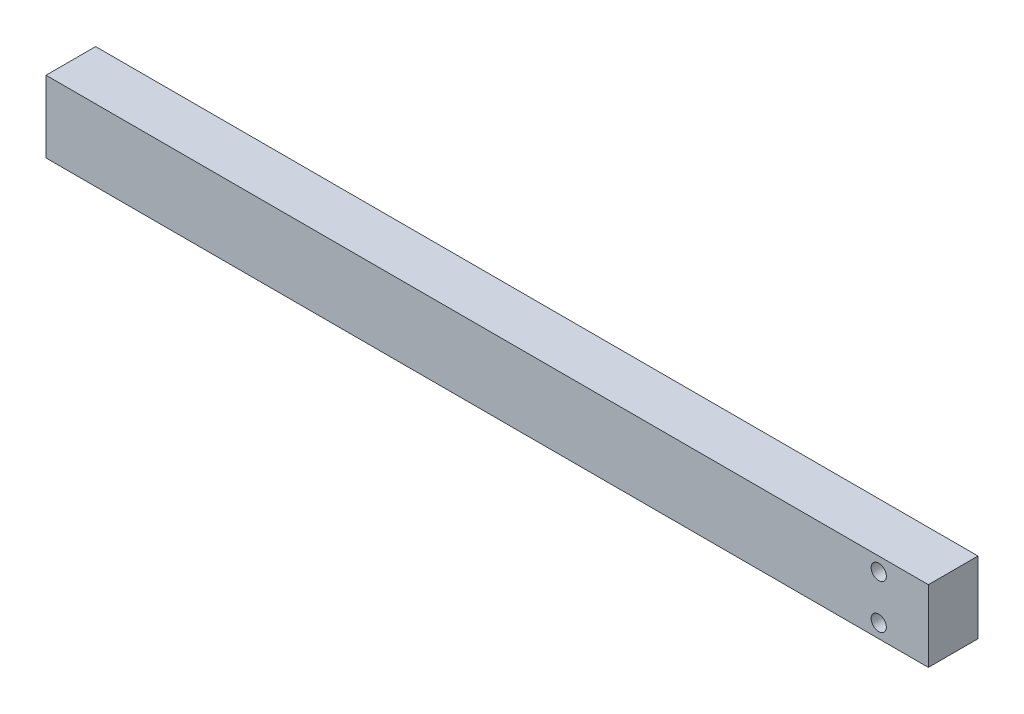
ISO-10303-21;
HEADER;
FILE_DESCRIPTION(('STEP AP214'),'2;1');
FILE_NAME('part.step','',(''),(''),'','','');
FILE_SCHEMA(('AUTOMOTIVE_DESIGN { 1 0 10303 214 1 1 1 1 }'));
ENDSEC;
DATA;
#1=APPLICATION_CONTEXT('core data for automotive mechanical design processes');
#2=APPLICATION_PROTOCOL_DEFINITION('international standard','automotive_design',2000,#1);
#3=PRODUCT_CONTEXT('',#1,'mechanical');
#4=PRODUCT('Part','Part','',(#3));
#5=PRODUCT_RELATED_PRODUCT_CATEGORY('part','',(#4));
#6=PRODUCT_DEFINITION_FORMATION('','',#4);
#7=PRODUCT_DEFINITION_CONTEXT('part definition',#1,'design');
#8=PRODUCT_DEFINITION('design','',#6,#7);
#9=PRODUCT_DEFINITION_SHAPE('','',#8);
#10=(LENGTH_UNIT() NAMED_UNIT(*) SI_UNIT(.MILLI.,.METRE.));
#11=(NAMED_UNIT(*) PLANE_ANGLE_UNIT() SI_UNIT($,.RADIAN.));
#12=(NAMED_UNIT(*) SI_UNIT($,.STERADIAN.) SOLID_ANGLE_UNIT());
#13=UNCERTAINTY_MEASURE_WITH_UNIT(LENGTH_MEASURE(1.E-05),#10,'distance_accuracy_value','');
#14=(GEOMETRIC_REPRESENTATION_CONTEXT(3) GLOBAL_UNCERTAINTY_ASSIGNED_CONTEXT((#13)) GLOBAL_UNIT_ASSIGNED_CONTEXT((#10,
#11,#12)) REPRESENTATION_CONTEXT('',''));
#15=CARTESIAN_POINT('',(0.,0.,0.));
#16=DIRECTION('',(0.,0.,1.));
#17=DIRECTION('',(1.,0.,0.));
#18=AXIS2_PLACEMENT_3D('',#15,#16,#17);
#19=CARTESIAN_POINT('',(1.11022302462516E-13,26.,0.));
#20=DIRECTION('',(0.,0.,-1.));
#21=DIRECTION('',(-1.,0.,0.));
#22=AXIS2_PLACEMENT_3D('',#19,#20,#21);
#23=PLANE('',#22);
#24=CARTESIAN_POINT('',(302.,4.99999999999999,0.));
#25=DIRECTION('',(0.,0.,1.));
#26=DIRECTION('',(1.,0.,0.));
#27=AXIS2_PLACEMENT_3D('',#24,#25,#26);
#28=CIRCLE('',#27,2.74999999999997);
#29=CARTESIAN_POINT('',(304.75,4.99999999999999,0.));
#30=VERTEX_POINT('',#29);
#31=EDGE_CURVE('E96',#30,#30,#28,.T.);
#32=ORIENTED_EDGE('',*,*,#31,.T.);
#33=EDGE_LOOP('',(#32));
#34=FACE_BOUND('',#33,.T.);
#35=DIRECTION('',(0.,-1.,0.));
#36=VECTOR('',#35,1.);
#37=CARTESIAN_POINT('',(0.,0.,0.));
#38=LINE('',#37,#36);
#39=CARTESIAN_POINT('',(1.11022302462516E-13,26.,0.));
#40=VERTEX_POINT('',#39);
#41=CARTESIAN_POINT('',(0.,0.,0.));
#42=VERTEX_POINT('',#41);
#43=EDGE_CURVE('E110',#40,#42,#38,.T.);
#44=ORIENTED_EDGE('',*,*,#43,.F.);
#45=DIRECTION('',(-1.,0.,0.));
#46=VECTOR('',#45,1.);
#47=CARTESIAN_POINT('',(1.11022302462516E-13,26.,0.));
#48=LINE('',#47,#46);
#49=CARTESIAN_POINT('',(320.,26.,0.));
#50=VERTEX_POINT('',#49);
#51=EDGE_CURVE('E73',#50,#40,#48,.T.);
#52=ORIENTED_EDGE('',*,*,#51,.F.);
#53=DIRECTION('',(0.,1.,0.));
#54=VECTOR('',#53,1.);
#55=CARTESIAN_POINT('',(320.,0.,0.));
#56=LINE('',#55,#54);
#57=CARTESIAN_POINT('',(320.,0.,0.));
#58=VERTEX_POINT('',#57);
#59=EDGE_CURVE('E67',#58,#50,#56,.T.);
#60=ORIENTED_EDGE('',*,*,#59,.F.);
#61=DIRECTION('',(1.,0.,0.));
#62=VECTOR('',#61,1.);
#63=CARTESIAN_POINT('',(0.,0.,0.));
#64=LINE('',#63,#62);
#65=EDGE_CURVE('E120',#42,#58,#64,.T.);
#66=ORIENTED_EDGE('',*,*,#65,.F.);
#67=EDGE_LOOP('',(#44,#52,#60,#66));
#68=FACE_BOUND('',#67,.T.);
#69=CARTESIAN_POINT('',(302.,21.,0.));
#70=DIRECTION('',(0.,0.,1.));
#71=DIRECTION('',(1.,0.,0.));
#72=AXIS2_PLACEMENT_3D('',#69,#70,#71);
#73=CIRCLE('',#72,2.74999999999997);
#74=CARTESIAN_POINT('',(304.75,21.,0.));
#75=VERTEX_POINT('',#74);
#76=EDGE_CURVE('E104',#75,#75,#73,.T.);
#77=ORIENTED_EDGE('',*,*,#76,.T.);
#78=EDGE_LOOP('',(#77));
#79=FACE_BOUND('',#78,.T.);
#80=ADVANCED_FACE('F32',(#34,#68,#79),#23,.T.);
#81=CARTESIAN_POINT('',(1.11022302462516E-13,0.,18.));
#82=DIRECTION('',(1.,0.,0.));
#83=DIRECTION('',(0.,0.,-1.));
#84=AXIS2_PLACEMENT_3D('',#81,#82,#83);
#85=PLANE('',#84);
#86=CARTESIAN_POINT('',(1.11022302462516E-13,13.,9.));
#87=DIRECTION('',(-1.,0.,0.));
#88=DIRECTION('',(0.,0.,1.));
#89=AXIS2_PLACEMENT_3D('',#86,#87,#88);
#90=CIRCLE('',#89,5.1);
#91=CARTESIAN_POINT('',(1.11022302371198E-13,13.,14.1));
#92=VERTEX_POINT('',#91);
#93=EDGE_CURVE('E93',#92,#92,#90,.T.);
#94=ORIENTED_EDGE('',*,*,#93,.F.);
#95=EDGE_LOOP('',(#94));
#96=FACE_BOUND('',#95,.T.);
#97=ORIENTED_EDGE('',*,*,#43,.T.);
#98=DIRECTION('',(0.,0.,-1.));
#99=VECTOR('',#98,1.);
#100=CARTESIAN_POINT('',(1.11022302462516E-13,0.,18.));
#101=LINE('',#100,#99);
#102=CARTESIAN_POINT('',(1.11022302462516E-13,0.,18.));
#103=VERTEX_POINT('',#102);
#104=EDGE_CURVE('E11',#103,#42,#101,.T.);
#105=ORIENTED_EDGE('',*,*,#104,.F.);
#106=DIRECTION('',(0.,-1.,0.));
#107=VECTOR('',#106,1.);
#108=CARTESIAN_POINT('',(1.11022302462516E-13,0.,18.));
#109=LINE('',#108,#107);
#110=CARTESIAN_POINT('',(0.,26.,18.));
#111=VERTEX_POINT('',#110);
#112=EDGE_CURVE('E111',#111,#103,#109,.T.);
#113=ORIENTED_EDGE('',*,*,#112,.F.);
#114=DIRECTION('',(0.,0.,-1.));
#115=VECTOR('',#114,1.);
#116=CARTESIAN_POINT('',(0.,26.,18.));
#117=LINE('',#116,#115);
#118=EDGE_CURVE('E117',#111,#40,#117,.T.);
#119=ORIENTED_EDGE('',*,*,#118,.T.);
#120=EDGE_LOOP('',(#97,#105,#113,#119));
#121=FACE_BOUND('',#120,.T.);
#122=ADVANCED_FACE('F34',(#96,#121),#85,.F.);
#123=CARTESIAN_POINT('',(1.11022302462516E-13,0.,18.));
#124=DIRECTION('',(0.,1.,0.));
#125=DIRECTION('',(0.,0.,1.));
#126=AXIS2_PLACEMENT_3D('',#123,#124,#125);
#127=PLANE('',#126);
#128=ORIENTED_EDGE('',*,*,#65,.T.);
#129=DIRECTION('',(0.,0.,-1.));
#130=VECTOR('',#129,1.);
#131=CARTESIAN_POINT('',(320.,0.,18.));
#132=LINE('',#131,#130);
#133=CARTESIAN_POINT('',(320.,0.,18.));
#134=VERTEX_POINT('',#133);
#135=EDGE_CURVE('E41',#134,#58,#132,.T.);
#136=ORIENTED_EDGE('',*,*,#135,.F.);
#137=DIRECTION('',(1.,0.,0.));
#138=VECTOR('',#137,1.);
#139=CARTESIAN_POINT('',(1.11022302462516E-13,0.,18.));
#140=LINE('',#139,#138);
#141=EDGE_CURVE('E80',#103,#134,#140,.T.);
#142=ORIENTED_EDGE('',*,*,#141,.F.);
#143=ORIENTED_EDGE('',*,*,#104,.T.);
#144=EDGE_LOOP('',(#128,#136,#142,#143));
#145=FACE_BOUND('',#144,.T.);
#146=ADVANCED_FACE('F145',(#145),#127,.F.);
#147=CARTESIAN_POINT('',(320.,0.,18.));
#148=DIRECTION('',(-1.,0.,0.));
#149=DIRECTION('',(0.,0.,1.));
#150=AXIS2_PLACEMENT_3D('',#147,#148,#149);
#151=PLANE('',#150);
#152=ORIENTED_EDGE('',*,*,#59,.T.);
#153=DIRECTION('',(0.,0.,-1.));
#154=VECTOR('',#153,1.);
#155=CARTESIAN_POINT('',(320.,26.,18.));
#156=LINE('',#155,#154);
#157=CARTESIAN_POINT('',(320.,26.,18.));
#158=VERTEX_POINT('',#157);
#159=EDGE_CURVE('E125',#158,#50,#156,.T.);
#160=ORIENTED_EDGE('',*,*,#159,.F.);
#161=DIRECTION('',(0.,1.,0.));
#162=VECTOR('',#161,1.);
#163=CARTESIAN_POINT('',(320.,0.,18.));
#164=LINE('',#163,#162);
#165=EDGE_CURVE('E114',#134,#158,#164,.T.);
#166=ORIENTED_EDGE('',*,*,#165,.F.);
#167=ORIENTED_EDGE('',*,*,#135,.T.);
#168=EDGE_LOOP('',(#152,#160,#166,#167));
#169=FACE_BOUND('',#168,.T.);
#170=ADVANCED_FACE('F127',(#169),#151,.F.);
#171=CARTESIAN_POINT('',(0.,26.,18.));
#172=DIRECTION('',(0.,-1.,0.));
#173=DIRECTION('',(0.,0.,-1.));
#174=AXIS2_PLACEMENT_3D('',#171,#172,#173);
#175=PLANE('',#174);
#176=ORIENTED_EDGE('',*,*,#51,.T.);
#177=ORIENTED_EDGE('',*,*,#118,.F.);
#178=DIRECTION('',(-1.,0.,0.));
#179=VECTOR('',#178,1.);
#180=CARTESIAN_POINT('',(0.,26.,18.));
#181=LINE('',#180,#179);
#182=EDGE_CURVE('E49',#158,#111,#181,.T.);
#183=ORIENTED_EDGE('',*,*,#182,.F.);
#184=ORIENTED_EDGE('',*,*,#159,.T.);
#185=EDGE_LOOP('',(#176,#177,#183,#184));
#186=FACE_BOUND('',#185,.T.);
#187=ADVANCED_FACE('F134',(#186),#175,.F.);
#188=CARTESIAN_POINT('',(0.,26.,18.));
#189=DIRECTION('',(0.,0.,-1.));
#190=DIRECTION('',(-1.,0.,0.));
#191=AXIS2_PLACEMENT_3D('',#188,#189,#190);
#192=PLANE('',#191);
#193=CARTESIAN_POINT('',(302.,4.99999999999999,18.));
#194=DIRECTION('',(0.,0.,1.));
#195=DIRECTION('',(1.,0.,0.));
#196=AXIS2_PLACEMENT_3D('',#193,#194,#195);
#197=CIRCLE('',#196,2.74999999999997);
#198=CARTESIAN_POINT('',(304.75,4.99999999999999,18.));
#199=VERTEX_POINT('',#198);
#200=EDGE_CURVE('E101',#199,#199,#197,.T.);
#201=ORIENTED_EDGE('',*,*,#200,.F.);
#202=EDGE_LOOP('',(#201));
#203=FACE_BOUND('',#202,.T.);
#204=CARTESIAN_POINT('',(302.,21.,18.));
#205=DIRECTION('',(0.,0.,1.));
#206=DIRECTION('',(1.,0.,0.));
#207=AXIS2_PLACEMENT_3D('',#204,#205,#206);
#208=CIRCLE('',#207,2.74999999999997);
#209=CARTESIAN_POINT('',(304.75,21.,18.));
#210=VERTEX_POINT('',#209);
#211=EDGE_CURVE('E107',#210,#210,#208,.T.);
#212=ORIENTED_EDGE('',*,*,#211,.F.);
#213=EDGE_LOOP('',(#212));
#214=FACE_BOUND('',#213,.T.);
#215=ORIENTED_EDGE('',*,*,#112,.T.);
#216=ORIENTED_EDGE('',*,*,#141,.T.);
#217=ORIENTED_EDGE('',*,*,#165,.T.);
#218=ORIENTED_EDGE('',*,*,#182,.T.);
#219=EDGE_LOOP('',(#215,#216,#217,#218));
#220=FACE_BOUND('',#219,.T.);
#221=ADVANCED_FACE('F136',(#203,#214,#220),#192,.F.);
#222=CARTESIAN_POINT('',(302.,21.,18.));
#223=DIRECTION('',(0.,0.,1.));
#224=DIRECTION('',(1.,0.,0.));
#225=AXIS2_PLACEMENT_3D('',#222,#223,#224);
#226=CYLINDRICAL_SURFACE('',#225,2.74999999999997);
#227=CARTESIAN_POINT('',(304.75,21.,0.));
#228=CARTESIAN_POINT('',(304.75,21.,0.187500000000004));
#229=CARTESIAN_POINT('',(304.75,21.,0.375000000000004));
#230=CARTESIAN_POINT('',(304.75,21.,0.750000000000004));
#231=CARTESIAN_POINT('',(304.75,21.,0.937500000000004));
#232=CARTESIAN_POINT('',(304.75,21.,1.3125));
#233=CARTESIAN_POINT('',(304.75,21.,1.5));
#234=CARTESIAN_POINT('',(304.75,21.,1.875));
#235=CARTESIAN_POINT('',(304.75,21.,2.0625));
#236=CARTESIAN_POINT('',(304.75,21.,2.4375));
#237=CARTESIAN_POINT('',(304.75,21.,2.625));
#238=CARTESIAN_POINT('',(304.75,21.,3.));
#239=CARTESIAN_POINT('',(304.75,21.,3.1875));
#240=CARTESIAN_POINT('',(304.75,21.,3.5625));
#241=CARTESIAN_POINT('',(304.75,21.,3.75));
#242=CARTESIAN_POINT('',(304.75,21.,4.125));
#243=CARTESIAN_POINT('',(304.75,21.,4.3125));
#244=CARTESIAN_POINT('',(304.75,21.,4.6875));
#245=CARTESIAN_POINT('',(304.75,21.,4.875));
#246=CARTESIAN_POINT('',(304.75,21.,5.25));
#247=CARTESIAN_POINT('',(304.75,21.,5.4375));
#248=CARTESIAN_POINT('',(304.75,21.,5.8125));
#249=CARTESIAN_POINT('',(304.75,21.,6.));
#250=CARTESIAN_POINT('',(304.75,21.,6.375));
#251=CARTESIAN_POINT('',(304.75,21.,6.5625));
#252=CARTESIAN_POINT('',(304.75,21.,6.9375));
#253=CARTESIAN_POINT('',(304.75,21.,7.125));
#254=CARTESIAN_POINT('',(304.75,21.,7.5));
#255=CARTESIAN_POINT('',(304.75,21.,7.6875));
#256=CARTESIAN_POINT('',(304.75,21.,8.0625));
#257=CARTESIAN_POINT('',(304.75,21.,8.25));
#258=CARTESIAN_POINT('',(304.75,21.,8.625));
#259=CARTESIAN_POINT('',(304.75,21.,8.8125));
#260=CARTESIAN_POINT('',(304.75,21.,9.1875));
#261=CARTESIAN_POINT('',(304.75,21.,9.375));
#262=CARTESIAN_POINT('',(304.75,21.,9.75));
#263=CARTESIAN_POINT('',(304.75,21.,9.9375));
#264=CARTESIAN_POINT('',(304.75,21.,10.3125));
#265=CARTESIAN_POINT('',(304.75,21.,10.5));
#266=CARTESIAN_POINT('',(304.75,21.,10.875));
#267=CARTESIAN_POINT('',(304.75,21.,11.0625));
#268=CARTESIAN_POINT('',(304.75,21.,11.4375));
#269=CARTESIAN_POINT('',(304.75,21.,11.625));
#270=CARTESIAN_POINT('',(304.75,21.,12.));
#271=CARTESIAN_POINT('',(304.75,21.,12.1875));
#272=CARTESIAN_POINT('',(304.75,21.,12.5625));
#273=CARTESIAN_POINT('',(304.75,21.,12.75));
#274=CARTESIAN_POINT('',(304.75,21.,13.125));
#275=CARTESIAN_POINT('',(304.75,21.,13.3125));
#276=CARTESIAN_POINT('',(304.75,21.,13.6875));
#277=CARTESIAN_POINT('',(304.75,21.,13.875));
#278=CARTESIAN_POINT('',(304.75,21.,14.25));
#279=CARTESIAN_POINT('',(304.75,21.,14.4375));
#280=CARTESIAN_POINT('',(304.75,21.,14.8125));
#281=CARTESIAN_POINT('',(304.75,21.,15.));
#282=CARTESIAN_POINT('',(304.75,21.,15.375));
#283=CARTESIAN_POINT('',(304.75,21.,15.5625));
#284=CARTESIAN_POINT('',(304.75,21.,15.9375));
#285=CARTESIAN_POINT('',(304.75,21.,16.125));
#286=CARTESIAN_POINT('',(304.75,21.,16.5));
#287=CARTESIAN_POINT('',(304.75,21.,16.6875));
#288=CARTESIAN_POINT('',(304.75,21.,17.0625));
#289=CARTESIAN_POINT('',(304.75,21.,17.25));
#290=CARTESIAN_POINT('',(304.75,21.,17.625));
#291=CARTESIAN_POINT('',(304.75,21.,17.8125));
#292=CARTESIAN_POINT('',(304.75,21.,18.));
#293=B_SPLINE_CURVE_WITH_KNOTS('',3,(#227,#228,#229,#230,#231,#232,#233,#234,#235,#236,#237,
#238,#239,#240,#241,#242,#243,#244,#245,#246,#247,#248,#249,#250,#251,#252,#253,#254,#255,#256,
#257,#258,#259,#260,#261,#262,#263,#264,#265,#266,#267,#268,#269,#270,#271,#272,#273,#274,#275,
#276,#277,#278,#279,#280,#281,#282,#283,#284,#285,#286,#287,#288,#289,#290,#291,#292),
.UNSPECIFIED.,.F.,.F.,(4,2,2,2,2,2,2,2,2,2,2,2,2,2,2,2,2,2,2,2,2,2,2,2,2,2,2,2,2,2,2,2,4),(0.,
0.5625,1.125,1.6875,2.25,2.8125,3.375,3.9375,4.5,5.0625,5.625,6.1875,6.75,7.31249999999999,
7.87499999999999,8.43749999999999,8.99999999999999,9.56249999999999,10.125,10.6875,11.25,
11.8125,12.375,12.9375,13.5,14.0625,14.625,15.1875,15.75,16.3125,16.875,17.4375,18.),.UNSPECIFIED.);
#294=EDGE_CURVE('BSEAM142',#75,#210,#293,.T.);
#295=ORIENTED_EDGE('',*,*,#76,.F.);
#296=ORIENTED_EDGE('',*,*,#211,.T.);
#297=ORIENTED_EDGE('',*,*,#294,.T.);
#298=ORIENTED_EDGE('',*,*,#294,.F.);
#299=EDGE_LOOP('',(#295,#297,#296,#298));
#300=FACE_BOUND('',#299,.T.);
#301=ADVANCED_FACE('F142',(#300),#226,.F.);
#302=CARTESIAN_POINT('',(302.,4.99999999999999,18.));
#303=DIRECTION('',(0.,0.,1.));
#304=DIRECTION('',(1.,0.,0.));
#305=AXIS2_PLACEMENT_3D('',#302,#303,#304);
#306=CYLINDRICAL_SURFACE('',#305,2.74999999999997);
#307=CARTESIAN_POINT('',(304.75,4.99999999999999,0.));
#308=CARTESIAN_POINT('',(304.75,4.99999999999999,0.187500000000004));
#309=CARTESIAN_POINT('',(304.75,4.99999999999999,0.375000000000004));
#310=CARTESIAN_POINT('',(304.75,4.99999999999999,0.750000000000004));
#311=CARTESIAN_POINT('',(304.75,4.99999999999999,0.937500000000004));
#312=CARTESIAN_POINT('',(304.75,4.99999999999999,1.3125));
#313=CARTESIAN_POINT('',(304.75,4.99999999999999,1.5));
#314=CARTESIAN_POINT('',(304.75,4.99999999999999,1.87500000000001));
#315=CARTESIAN_POINT('',(304.75,4.99999999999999,2.06250000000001));
#316=CARTESIAN_POINT('',(304.75,4.99999999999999,2.43750000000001));
#317=CARTESIAN_POINT('',(304.75,4.99999999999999,2.625));
#318=CARTESIAN_POINT('',(304.75,4.99999999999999,3.));
#319=CARTESIAN_POINT('',(304.75,4.99999999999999,3.1875));
#320=CARTESIAN_POINT('',(304.75,4.99999999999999,3.5625));
#321=CARTESIAN_POINT('',(304.75,4.99999999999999,3.75));
#322=CARTESIAN_POINT('',(304.75,4.99999999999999,4.125));
#323=CARTESIAN_POINT('',(304.75,4.99999999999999,4.3125));
#324=CARTESIAN_POINT('',(304.75,4.99999999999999,4.6875));
#325=CARTESIAN_POINT('',(304.75,4.99999999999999,4.875));
#326=CARTESIAN_POINT('',(304.75,4.99999999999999,5.25));
#327=CARTESIAN_POINT('',(304.75,4.99999999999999,5.4375));
#328=CARTESIAN_POINT('',(304.75,4.99999999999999,5.81250000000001));
#329=CARTESIAN_POINT('',(304.75,4.99999999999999,6.00000000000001));
#330=CARTESIAN_POINT('',(304.75,4.99999999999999,6.375));
#331=CARTESIAN_POINT('',(304.75,4.99999999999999,6.56250000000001));
#332=CARTESIAN_POINT('',(304.75,4.99999999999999,6.9375));
#333=CARTESIAN_POINT('',(304.75,4.99999999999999,7.125));
#334=CARTESIAN_POINT('',(304.75,4.99999999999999,7.5));
#335=CARTESIAN_POINT('',(304.75,4.99999999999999,7.6875));
#336=CARTESIAN_POINT('',(304.75,4.99999999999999,8.0625));
#337=CARTESIAN_POINT('',(304.75,4.99999999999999,8.25));
#338=CARTESIAN_POINT('',(304.75,4.99999999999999,8.625));
#339=CARTESIAN_POINT('',(304.75,4.99999999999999,8.8125));
#340=CARTESIAN_POINT('',(304.75,4.99999999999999,9.18750000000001));
#341=CARTESIAN_POINT('',(304.75,4.99999999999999,9.37500000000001));
#342=CARTESIAN_POINT('',(304.75,4.99999999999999,9.75000000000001));
#343=CARTESIAN_POINT('',(304.75,4.99999999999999,9.93750000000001));
#344=CARTESIAN_POINT('',(304.75,4.99999999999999,10.3125));
#345=CARTESIAN_POINT('',(304.75,4.99999999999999,10.5));
#346=CARTESIAN_POINT('',(304.75,4.99999999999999,10.875));
#347=CARTESIAN_POINT('',(304.75,4.99999999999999,11.0625));
#348=CARTESIAN_POINT('',(304.75,4.99999999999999,11.4375));
#349=CARTESIAN_POINT('',(304.75,4.99999999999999,11.625));
#350=CARTESIAN_POINT('',(304.75,4.99999999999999,12.));
#351=CARTESIAN_POINT('',(304.75,4.99999999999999,12.1875));
#352=CARTESIAN_POINT('',(304.75,4.99999999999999,12.5625));
#353=CARTESIAN_POINT('',(304.75,4.99999999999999,12.75));
#354=CARTESIAN_POINT('',(304.75,4.99999999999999,13.125));
#355=CARTESIAN_POINT('',(304.75,4.99999999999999,13.3125));
#356=CARTESIAN_POINT('',(304.75,4.99999999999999,13.6875));
#357=CARTESIAN_POINT('',(304.75,4.99999999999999,13.875));
#358=CARTESIAN_POINT('',(304.75,4.99999999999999,14.25));
#359=CARTESIAN_POINT('',(304.75,4.99999999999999,14.4375));
#360=CARTESIAN_POINT('',(304.75,4.99999999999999,14.8125));
#361=CARTESIAN_POINT('',(304.75,4.99999999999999,15.));
#362=CARTESIAN_POINT('',(304.75,4.99999999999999,15.375));
#363=CARTESIAN_POINT('',(304.75,4.99999999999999,15.5625));
#364=CARTESIAN_POINT('',(304.75,4.99999999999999,15.9375));
#365=CARTESIAN_POINT('',(304.75,4.99999999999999,16.125));
#366=CARTESIAN_POINT('',(304.75,4.99999999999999,16.5));
#367=CARTESIAN_POINT('',(304.75,4.99999999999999,16.6875));
#368=CARTESIAN_POINT('',(304.75,4.99999999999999,17.0625));
#369=CARTESIAN_POINT('',(304.75,4.99999999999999,17.25));
#370=CARTESIAN_POINT('',(304.75,4.99999999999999,17.625));
#371=CARTESIAN_POINT('',(304.75,4.99999999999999,17.8125));
#372=CARTESIAN_POINT('',(304.75,4.99999999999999,18.));
#373=B_SPLINE_CURVE_WITH_KNOTS('',3,(#307,#308,#309,#310,#311,#312,#313,#314,#315,#316,#317,
#318,#319,#320,#321,#322,#323,#324,#325,#326,#327,#328,#329,#330,#331,#332,#333,#334,#335,#336,
#337,#338,#339,#340,#341,#342,#343,#344,#345,#346,#347,#348,#349,#350,#351,#352,#353,#354,#355,
#356,#357,#358,#359,#360,#361,#362,#363,#364,#365,#366,#367,#368,#369,#370,#371,#372),
.UNSPECIFIED.,.F.,.F.,(4,2,2,2,2,2,2,2,2,2,2,2,2,2,2,2,2,2,2,2,2,2,2,2,2,2,2,2,2,2,2,2,4),(0.,
0.5625,1.125,1.6875,2.25,2.8125,3.375,3.9375,4.5,5.0625,5.625,6.1875,6.75,7.3125,7.875,8.4375,
9.,9.5625,10.125,10.6875,11.25,11.8125,12.375,12.9375,13.5,14.0625,14.625,15.1875,15.75,16.3125,
16.875,17.4375,18.),.UNSPECIFIED.);
#374=EDGE_CURVE('BSEAM157',#30,#199,#373,.T.);
#375=ORIENTED_EDGE('',*,*,#31,.F.);
#376=ORIENTED_EDGE('',*,*,#200,.T.);
#377=ORIENTED_EDGE('',*,*,#374,.T.);
#378=ORIENTED_EDGE('',*,*,#374,.F.);
#379=EDGE_LOOP('',(#375,#377,#376,#378));
#380=FACE_BOUND('',#379,.T.);
#381=ADVANCED_FACE('F157',(#380),#306,.F.);
#382=CARTESIAN_POINT('',(1.11022302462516E-13,13.,9.));
#383=DIRECTION('',(-1.,0.,0.));
#384=DIRECTION('',(0.,0.,1.));
#385=AXIS2_PLACEMENT_3D('',#382,#383,#384);
#386=CYLINDRICAL_SURFACE('',#385,5.1);
#387=CARTESIAN_POINT('',(32.0000000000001,13.,9.));
#388=DIRECTION('',(-1.,0.,0.));
#389=DIRECTION('',(0.,0.,1.));
#390=AXIS2_PLACEMENT_3D('',#387,#388,#389);
#391=CIRCLE('',#390,5.09999999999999);
#392=CARTESIAN_POINT('',(32.0000000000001,13.,14.1));
#393=VERTEX_POINT('',#392);
#394=EDGE_CURVE('E91',#393,#393,#391,.T.);
#395=CARTESIAN_POINT('',(32.0000000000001,13.,14.1));
#396=CARTESIAN_POINT('',(31.6666666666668,13.,14.1));
#397=CARTESIAN_POINT('',(31.3333333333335,13.,14.1));
#398=CARTESIAN_POINT('',(30.6666666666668,13.,14.1));
#399=CARTESIAN_POINT('',(30.3333333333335,13.,14.1));
#400=CARTESIAN_POINT('',(29.6666666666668,13.,14.1));
#401=CARTESIAN_POINT('',(29.3333333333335,13.,14.1));
#402=CARTESIAN_POINT('',(28.6666666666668,13.,14.1));
#403=CARTESIAN_POINT('',(28.3333333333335,13.,14.1));
#404=CARTESIAN_POINT('',(27.6666666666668,13.,14.1));
#405=CARTESIAN_POINT('',(27.3333333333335,13.,14.1));
#406=CARTESIAN_POINT('',(26.6666666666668,13.,14.1));
#407=CARTESIAN_POINT('',(26.3333333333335,13.,14.1));
#408=CARTESIAN_POINT('',(25.6666666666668,13.,14.1));
#409=CARTESIAN_POINT('',(25.3333333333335,13.,14.1));
#410=CARTESIAN_POINT('',(24.6666666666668,13.,14.1));
#411=CARTESIAN_POINT('',(24.3333333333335,13.,14.1));
#412=CARTESIAN_POINT('',(23.6666666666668,13.,14.1));
#413=CARTESIAN_POINT('',(23.3333333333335,13.,14.1));
#414=CARTESIAN_POINT('',(22.6666666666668,13.,14.1));
#415=CARTESIAN_POINT('',(22.3333333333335,13.,14.1));
#416=CARTESIAN_POINT('',(21.6666666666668,13.,14.1));
#417=CARTESIAN_POINT('',(21.3333333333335,13.,14.1));
#418=CARTESIAN_POINT('',(20.6666666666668,13.,14.1));
#419=CARTESIAN_POINT('',(20.3333333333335,13.,14.1));
#420=CARTESIAN_POINT('',(19.6666666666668,13.,14.1));
#421=CARTESIAN_POINT('',(19.3333333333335,13.,14.1));
#422=CARTESIAN_POINT('',(18.6666666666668,13.,14.1));
#423=CARTESIAN_POINT('',(18.3333333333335,13.,14.1));
#424=CARTESIAN_POINT('',(17.6666666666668,13.,14.1));
#425=CARTESIAN_POINT('',(17.3333333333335,13.,14.1));
#426=CARTESIAN_POINT('',(16.6666666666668,13.,14.1));
#427=CARTESIAN_POINT('',(16.3333333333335,13.,14.1));
#428=CARTESIAN_POINT('',(15.6666666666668,13.,14.1));
#429=CARTESIAN_POINT('',(15.3333333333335,13.,14.1));
#430=CARTESIAN_POINT('',(14.6666666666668,13.,14.1));
#431=CARTESIAN_POINT('',(14.3333333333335,13.,14.1));
#432=CARTESIAN_POINT('',(13.6666666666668,13.,14.1));
#433=CARTESIAN_POINT('',(13.3333333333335,13.,14.1));
#434=CARTESIAN_POINT('',(12.6666666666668,13.,14.1));
#435=CARTESIAN_POINT('',(12.3333333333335,13.,14.1));
#436=CARTESIAN_POINT('',(11.6666666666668,13.,14.1));
#437=CARTESIAN_POINT('',(11.3333333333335,13.,14.1));
#438=CARTESIAN_POINT('',(10.6666666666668,13.,14.1));
#439=CARTESIAN_POINT('',(10.3333333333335,13.,14.1));
#440=CARTESIAN_POINT('',(9.66666666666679,13.,14.1));
#441=CARTESIAN_POINT('',(9.33333333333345,13.,14.1));
#442=CARTESIAN_POINT('',(8.66666666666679,13.,14.1));
#443=CARTESIAN_POINT('',(8.33333333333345,13.,14.1));
#444=CARTESIAN_POINT('',(7.66666666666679,13.,14.1));
#445=CARTESIAN_POINT('',(7.33333333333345,13.,14.1));
#446=CARTESIAN_POINT('',(6.66666666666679,13.,14.1));
#447=CARTESIAN_POINT('',(6.33333333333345,13.,14.1));
#448=CARTESIAN_POINT('',(5.66666666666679,13.,14.1));
#449=CARTESIAN_POINT('',(5.33333333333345,13.,14.1));
#450=CARTESIAN_POINT('',(4.66666666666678,13.,14.1));
#451=CARTESIAN_POINT('',(4.33333333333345,13.,14.1));
#452=CARTESIAN_POINT('',(3.66666666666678,13.,14.1));
#453=CARTESIAN_POINT('',(3.33333333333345,13.,14.1));
#454=CARTESIAN_POINT('',(2.66666666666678,13.,14.1));
#455=CARTESIAN_POINT('',(2.33333333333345,13.,14.1));
#456=CARTESIAN_POINT('',(1.66666666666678,13.,14.1));
#457=CARTESIAN_POINT('',(1.33333333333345,13.,14.1));
#458=CARTESIAN_POINT('',(0.666666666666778,13.,14.1));
#459=CARTESIAN_POINT('',(0.333333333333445,13.,14.1));
#460=CARTESIAN_POINT('',(1.11022302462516E-13,13.,14.1));
#461=B_SPLINE_CURVE_WITH_KNOTS('',3,(#395,#396,#397,#398,#399,#400,#401,#402,#403,#404,#405,
#406,#407,#408,#409,#410,#411,#412,#413,#414,#415,#416,#417,#418,#419,#420,#421,#422,#423,#424,
#425,#426,#427,#428,#429,#430,#431,#432,#433,#434,#435,#436,#437,#438,#439,#440,#441,#442,#443,
#444,#445,#446,#447,#448,#449,#450,#451,#452,#453,#454,#455,#456,#457,#458,#459,#460),
.UNSPECIFIED.,.F.,.F.,(4,2,2,2,2,2,2,2,2,2,2,2,2,2,2,2,2,2,2,2,2,2,2,2,2,2,2,2,2,2,2,2,4),(0.,
1.,2.,3.,4.,5.,6.00000000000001,7.00000000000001,8.00000000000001,9.00000000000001,10.,11.,12.,
13.,14.,15.,16.,17.,18.,19.,20.,21.,22.,23.,24.,25.,26.,27.,28.,29.,30.,31.,32.),.UNSPECIFIED.);
#462=EDGE_CURVE('BSEAM87',#393,#92,#461,.T.);
#463=ORIENTED_EDGE('',*,*,#394,.F.);
#464=ORIENTED_EDGE('',*,*,#93,.T.);
#465=ORIENTED_EDGE('',*,*,#462,.T.);
#466=ORIENTED_EDGE('',*,*,#462,.F.);
#467=EDGE_LOOP('',(#463,#465,#464,#466));
#468=FACE_BOUND('',#467,.T.);
#469=ADVANCED_FACE('F87',(#468),#386,.F.);
#470=CARTESIAN_POINT('',(32.0000000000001,13.,9.));
#471=DIRECTION('',(-1.,0.,0.));
#472=DIRECTION('',(0.,0.,1.));
#473=AXIS2_PLACEMENT_3D('',#470,#471,#472);
#474=CONICAL_SURFACE('',#473,5.09999999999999,1.02974425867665);
#475=CARTESIAN_POINT('',(35.0643891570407,13.,9.));
#476=VERTEX_POINT('',#475);
#477=VERTEX_LOOP('',#476);
#478=FACE_BOUND('',#477,.T.);
#479=ORIENTED_EDGE('',*,*,#394,.T.);
#480=EDGE_LOOP('',(#479));
#481=FACE_BOUND('',#480,.T.);
#482=ADVANCED_FACE('F84',(#478,#481),#474,.F.);
#483=CLOSED_SHELL('',(#80,#122,#146,#170,#187,#221,#301,#381,#469,#482));
#484=MANIFOLD_SOLID_BREP('B2',#483);
#485=ADVANCED_BREP_SHAPE_REPRESENTATION('',(#18,#484),#14);
#486=SHAPE_DEFINITION_REPRESENTATION(#9,#485);
ENDSEC;
END-ISO-10303-21;
